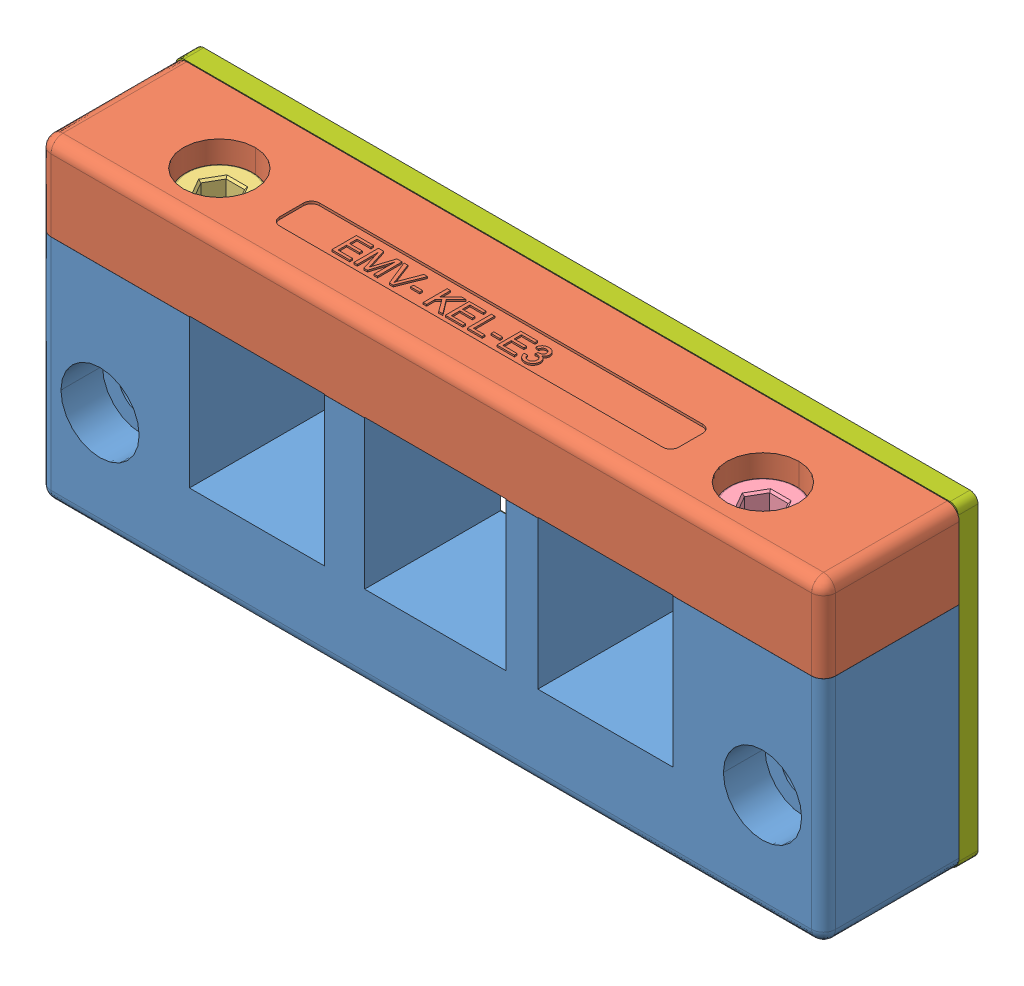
SolidWorks assembly 99420.SLDASM, configuration Default (file format 8000). Lengths in mm.
Overall size (98.3 39.6 19.5).
7 component instances, 7 part files, 0 mates.
Components (placement in the parent):
- 99420_01-1: 99420_01.SLDPRT [Default] at origin size (98.3 29 17)
- 99420_02-1: 99420_02.SLDPRT [Default] at origin size (98.3 10.5 17)
- 99420_03-1: 99420_03.SLDPRT [Default] at origin size (8.5 35 8.5)
- 99420_04-1: 99420_04.SLDPRT [Default] at origin size (8.5 35 8.5)
- 99420_05-1: 99420_05.SLDPRT [Default] at origin size (9.25 4.7 8.01)
- 99420_06-1: 99420_06.SLDPRT [Default] at origin size (9.25 4.7 8.01)
- 99420_07-1: 99420_07.SLDPRT [Default] at origin size (98 39.6 2.5)
